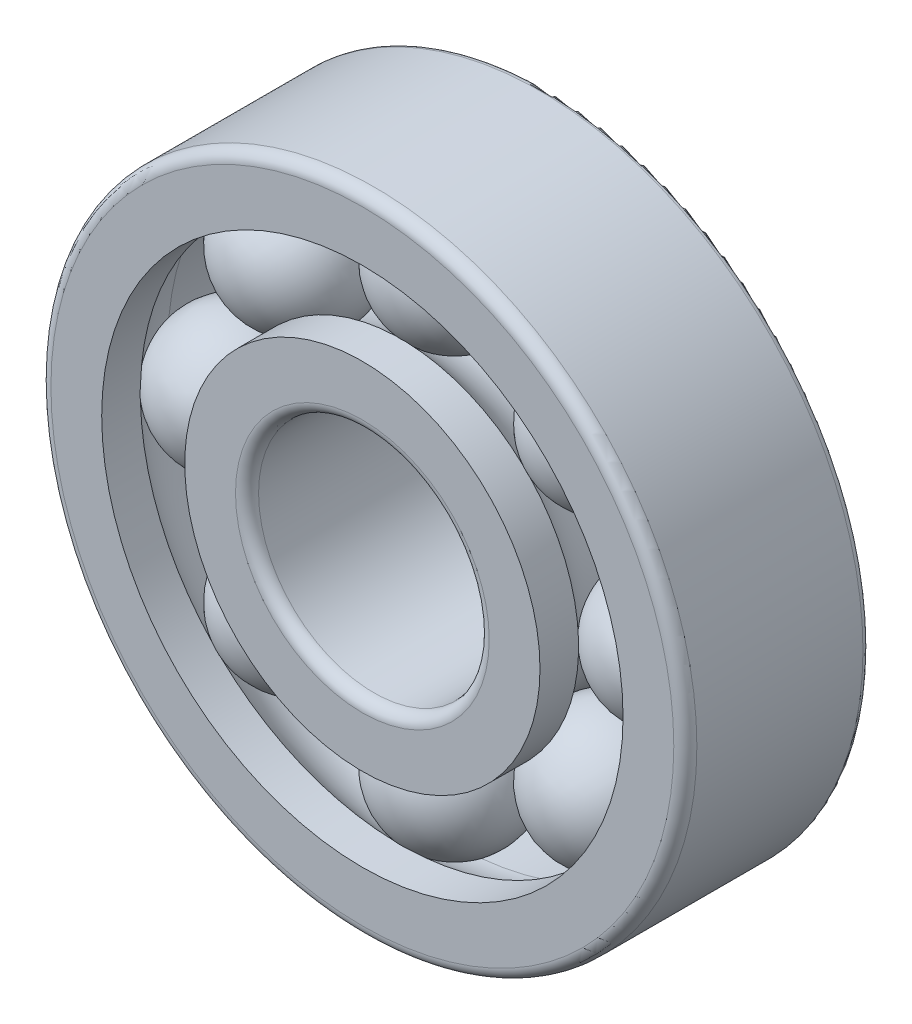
from build123d import *

# Parameters (mm, degrees)
FILLET1_R            = 0.5
FILLET2_R            = 0.3
CIRPATTERNBALL_COUNT = 8


with BuildPart() as part:
    # BaseSke → Ball (revolve)
    with BuildSketch(Plane(origin=(0, 0, 0), x_dir=(0, 0, -1), z_dir=(1, 0, 0))):
        with BuildLine():
            Line((0, 12.45), (0, 6.55))
            ThreePointArc((0, 6.55), (-2.95, 9.5), (0, 12.45))
        make_face()
    ball = revolve(axis=Axis((0, 12.45, 0), (0, -1, 0)))

    # OuterRaceSke → OuterRace (revolve)
    with BuildSketch(Plane(origin=(0, 0, 0), x_dir=(0, 0, -1), z_dir=(1, 0, 0)), mode=Mode.PRIVATE) as outerrace_sk:
        with BuildLine():
            Line((-4, 14), (4, 14))
            Line((4, 14), (4, 12.44))
            Line((4, 12.44), (0, 12.44))
            ThreePointArc((0, 12.44), (-1.294526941, 12.139659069), (-2.324564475, 11.3))
            Line((-2.324564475, 11.3), (-4, 11.3))
            Line((-4, 11.3), (-4, 14))
        make_face()
    revolve(outerrace_sk.sketch.rotate(Axis((0, 0, 50.391616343), (0, 0, -1)), 90), axis=Axis((0, 0, 50.391616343), (0, 0, -1)))

    # InnerRaceSke → InnerRace (revolve)
    with BuildSketch(Plane(origin=(0, 0, 0), x_dir=(0, 0, -1), z_dir=(1, 0, 0)), mode=Mode.PRIVATE) as innerrace_sk:
        with BuildLine():
            Line((-4, 5), (4, 5))
            Line((4, 5), (4, 7.7))
            Line((4, 7.7), (2.324564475, 7.7))
            ThreePointArc((2.324564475, 7.7), (0, 6.56), (-2.324564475, 7.7))
            Line((-2.324564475, 7.7), (-4, 7.7))
            Line((-4, 7.7), (-4, 5))
        make_face()
    revolve(innerrace_sk.sketch.rotate(Axis((0, 0, 70.862590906), (0, 0, -1)), 90), axis=Axis((0, 0, 70.862590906), (0, 0, -1)))

    # Fillet1
    fillet1_edges = [part.edges().sort_by_distance(p)[0] for p in [
        (-5, 0, 4),
        (-5, 0, -4),
        (-14, 0, 4),
    ]]
    fillet(fillet1_edges, radius=FILLET1_R)

    # Fillet2
    fillet2_edges = [part.edges().sort_by_distance(p)[0] for p in [
        (-14, 0, -4),
    ]]
    fillet(fillet2_edges, radius=FILLET2_R)

    # CirPatternBall: Ball ×8 about axis
    cirpatternball_axis = Axis((0, 0, 0), (0, 0, 1))
    for i in range(1, CIRPATTERNBALL_COUNT):
        add(ball.rotate(cirpatternball_axis, i * 360 / CIRPATTERNBALL_COUNT))


solid = part.part
